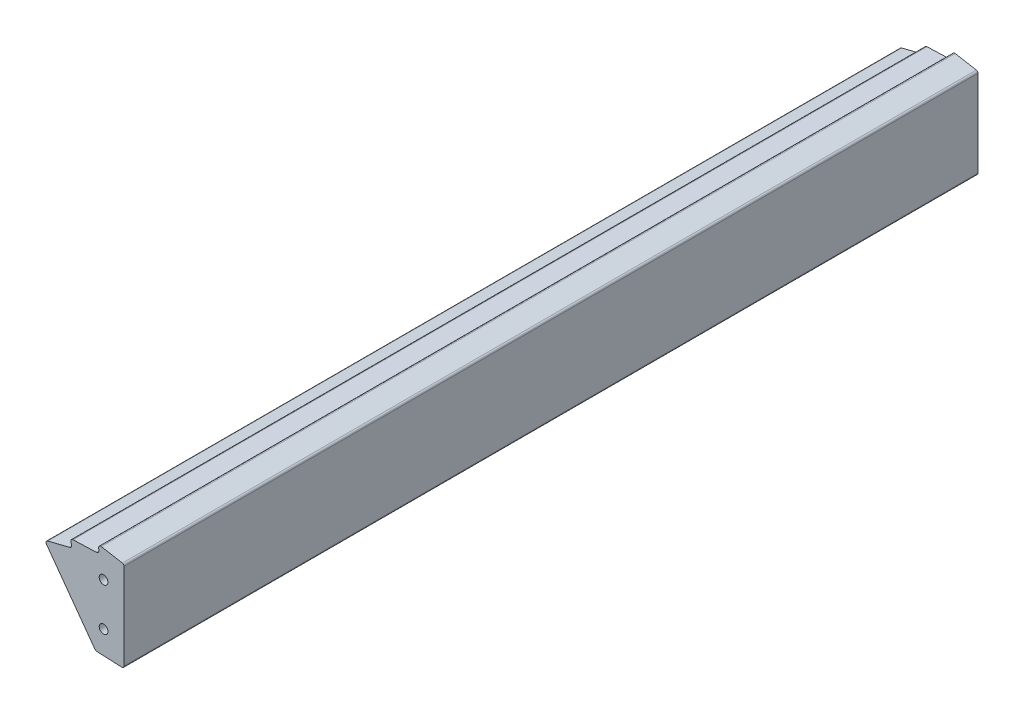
from build123d import *

# Parameters (mm, degrees)
EXTRUDE_THIN1_DEPTH                   = 137.50025
EXTRUDE_THIN1_DEPTH_BACK              = 213.5
BOSS_EXTRUDE1_DEPTH                   = 212.50025
BOSS_EXTRUDE1_DEPTH_BACK              = 288.5
SKETCH3_OUTSIDE_W                     = 604.22
SKETCH3_OUTSIDE_H                     = 158.409
SKETCH3_OUTSIDE_W_2                   = 500
SKETCH3_OUTSIDE_H_2                   = 100
CUT_EXTRUDE1_DEPTH                    = 304.404582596
F_1_4_20_TAPPED_HOLE1_D               = 5.1054
F_1_4_20_TAPPED_HOLE1_DEPTH           = 16.51
F_1_4_20_TAPPED_HOLE1_TIP             = 1.533816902
F_1_4_20_TAPPED_HOLE1_ON_FACE_2_D     = 5.1054
F_1_4_20_TAPPED_HOLE1_ON_FACE_2_DEPTH = 16.51
F_1_4_20_TAPPED_HOLE1_ON_FACE_2_TIP   = 1.533816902


with BuildPart() as part:
    # Sketch1 → Extrude-Thin1 (new, two sides: drawn at the far end of the back side and taken through both)
    with BuildSketch(Plane.XY.offset(-EXTRUDE_THIN1_DEPTH_BACK)):
        with BuildLine():
            Line((-1, 27.377741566), (-1, 77.801426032))
            ThreePointArc((-1, 77.801426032), (-1.350622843, 78.765237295), (-2.238576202, 79.278469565))
            Line((-2.238576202, 79.278469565), (-14.558703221, 81.459024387))
            ThreePointArc((-14.558703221, 81.459024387), (-15.894736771, 81.028505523), (-16.289731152, 79.681541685))
            Line((-16.289731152, 79.681541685), (-16.133756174, 78.918587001))
            ThreePointArc((-16.133756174, 78.918587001), (-16.425245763, 77.689683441), (-17.551976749, 77.11902818))
            Line((-17.551976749, 77.11902818), (-31.176844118, 76.65202466))
            ThreePointArc((-31.176844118, 76.65202466), (-32.394172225, 75.953136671), (-32.500485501, 74.553483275))
            Line((-32.500485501, 74.553483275), (-32.189291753, 73.839630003))
            ThreePointArc((-32.189291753, 73.839630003), (-32.218908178, 72.576976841), (-33.202371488, 71.784531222))
            Line((-33.202371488, 71.784531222), (-46.048094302, 68.590520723))
            ThreePointArc((-46.048094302, 68.590520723), (-47.095522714, 67.648327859), (-46.899674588, 66.253165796))
            Line((-46.899674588, 66.253165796), (-18.735090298, 27.487941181))
            ThreePointArc((-18.735090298, 27.487941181), (-17.958226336, 26.809018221), (-16.963801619, 26.534111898))
            Line((-16.963801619, 26.534111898), (-2.568160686, 25.879290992))
            ThreePointArc((-2.568160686, 25.879290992), (-1.463718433, 26.293250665), (-1, 27.377741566))
        make_face()
        with BuildLine():
            Line((-1.27, 27.377741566), (-1.27, 77.801426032))
            ThreePointArc((-1.27, 77.801426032), (-1.557510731, 78.591751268), (-2.285632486, 79.012601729))
            Line((-2.285632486, 79.012601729), (-14.605759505, 81.193156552))
            ThreePointArc((-14.605759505, 81.193156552), (-15.701307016, 80.840131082), (-16.025202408, 79.735620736))
            Line((-16.025202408, 79.735620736), (-15.86922743, 78.972666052))
            ThreePointArc((-15.86922743, 78.972666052), (-16.213185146, 77.522559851), (-17.542727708, 76.849186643))
            Line((-17.542727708, 76.849186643), (-31.167595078, 76.382183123))
            ThreePointArc((-31.167595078, 76.382183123), (-32.165804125, 75.809094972), (-32.252981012, 74.661379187))
            Line((-32.252981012, 74.661379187), (-31.941787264, 73.947525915))
            ThreePointArc((-31.941787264, 73.947525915), (-31.976734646, 72.457595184), (-33.137221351, 71.522509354))
            Line((-33.137221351, 71.522509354), (-45.982944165, 68.328498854))
            ThreePointArc((-45.982944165, 68.328498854), (-46.841835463, 67.555900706), (-46.68124, 66.411867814))
            Line((-46.68124, 66.411867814), (-18.516655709, 27.646643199))
            ThreePointArc((-18.516655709, 27.646643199), (-17.830213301, 27.046742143), (-16.951532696, 26.803833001))
            Line((-16.951532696, 26.803833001), (-2.555891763, 26.149012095))
            ThreePointArc((-2.555891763, 26.149012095), (-1.650249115, 26.488459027), (-1.27, 27.377741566))
        make_face(mode=Mode.SUBTRACT)
    extrude(amount=EXTRUDE_THIN1_DEPTH + EXTRUDE_THIN1_DEPTH_BACK)


with BuildPart() as body_2:
    # Sketch2 → Boss-Extrude1 (new, two sides: drawn at the far end of the back side and taken through both)
    with BuildSketch(Plane.XY.offset(-BOSS_EXTRUDE1_DEPTH_BACK)):
        with BuildLine():
            Line((-46.68124, 66.411867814), (-18.516655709, 27.646643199))
            ThreePointArc((-18.516655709, 27.646643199), (-17.830213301, 27.046742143), (-16.951532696, 26.803833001))
            Line((-16.951532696, 26.803833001), (-2.555891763, 26.149012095))
            ThreePointArc((-2.555891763, 26.149012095), (-1.650249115, 26.488459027), (-1.27, 27.377741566))
            Line((-1.27, 27.377741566), (-1.27, 77.801426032))
            Line((-1.27, 77.801426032), (-1.27, 77.950492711))
            ThreePointArc((-1.27, 77.950492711), (-1.551343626, 78.723865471), (-2.263847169, 79.13568869))
            Line((-2.263847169, 79.13568869), (-14.583974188, 81.316243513))
            ThreePointArc((-14.583974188, 81.316243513), (-15.790857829, 80.927341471), (-16.147669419, 79.710584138))
            Line((-16.147669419, 79.710584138), (-15.991694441, 78.947629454))
            ThreePointArc((-15.991694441, 78.947629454), (-16.311361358, 77.599931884), (-17.547009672, 76.97411328))
            Line((-17.547009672, 76.97411328), (-31.171877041, 76.50710976))
            ThreePointArc((-31.171877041, 76.50710976), (-32.271530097, 75.875780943), (-32.367566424, 74.611427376))
            Line((-32.367566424, 74.611427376), (-32.056372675, 73.897574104))
            ThreePointArc((-32.056372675, 73.897574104), (-32.088852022, 72.51286447), (-33.167383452, 71.643815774))
            Line((-33.167383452, 71.643815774), (-46.013106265, 68.449805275))
            ThreePointArc((-46.013106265, 68.449805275), (-46.895812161, 67.655785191), (-46.730763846, 66.48003154))
            Line((-46.730763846, 66.48003154), (-46.68124, 66.411867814))
        make_face()
    extrude(amount=BOSS_EXTRUDE1_DEPTH + BOSS_EXTRUDE1_DEPTH_BACK)

    # Sketch3 outside → Cut-Extrude1 (cut, through all)
    with BuildSketch(Plane(origin=(0, 0, 0), x_dir=(0, 0, -1), z_dir=(1, 0, 0))):
        with Locations((38, 53.7425)):
            Rectangle(SKETCH3_OUTSIDE_W, SKETCH3_OUTSIDE_H)
        with Locations((37.999875, 52.664117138)):
            Rectangle(SKETCH3_OUTSIDE_W_2, SKETCH3_OUTSIDE_H_2, mode=Mode.SUBTRACT)
    extrude(amount=-CUT_EXTRUDE1_DEPTH, mode=Mode.SUBTRACT)

    # 1_4-20 Tapped Hole1
    with Locations(Plane(origin=(-13.27, 65.164117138, 212.000125), x_dir=(1, 0, 0), z_dir=(0, 0, 1))):
        with Locations((0, 0), (0, -25)):
            Hole(F_1_4_20_TAPPED_HOLE1_D / 2, depth=F_1_4_20_TAPPED_HOLE1_DEPTH)
            with Locations((0, 0, -(F_1_4_20_TAPPED_HOLE1_DEPTH + F_1_4_20_TAPPED_HOLE1_TIP / 2))):  # 118° drill point
                Cone(0, F_1_4_20_TAPPED_HOLE1_D / 2, F_1_4_20_TAPPED_HOLE1_TIP, mode=Mode.SUBTRACT)

    # 1_4-20 Tapped Hole1 on face 2
    with Locations(Plane(origin=(-13.27, 65.164117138, -287.999875), x_dir=(-1, 0, 0), z_dir=(0, 0, -1))):
        with Locations((0, 0), (0, -25)):
            Hole(F_1_4_20_TAPPED_HOLE1_ON_FACE_2_D / 2, depth=F_1_4_20_TAPPED_HOLE1_ON_FACE_2_DEPTH)
            with Locations((0, 0, -(F_1_4_20_TAPPED_HOLE1_ON_FACE_2_DEPTH + F_1_4_20_TAPPED_HOLE1_ON_FACE_2_TIP / 2))):  # 118° drill point
                Cone(0, F_1_4_20_TAPPED_HOLE1_ON_FACE_2_D / 2, F_1_4_20_TAPPED_HOLE1_ON_FACE_2_TIP, mode=Mode.SUBTRACT)


solid = body_2.part
